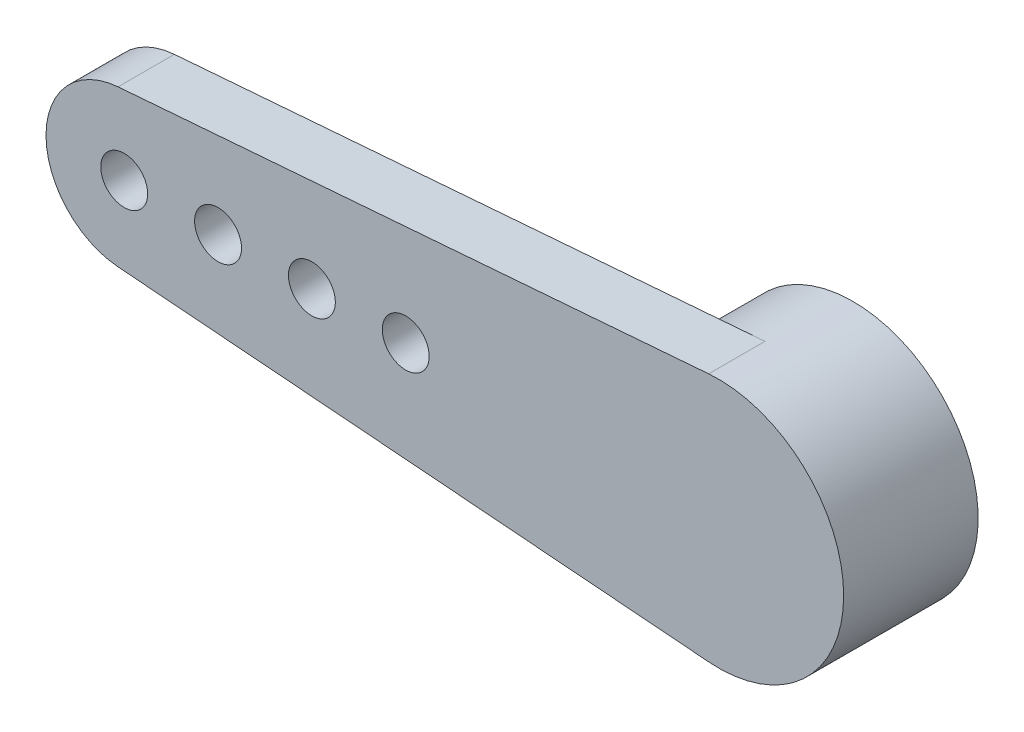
from build123d import *

# Parameters (mm, degrees)
ESQUISSE1_R      = 0.75
EXTRUSION6_DEPTH = 1.8
EXTRUSION8_START = 2.5
ESQUISSE3_R      = 4
EXTRUSION8_DEPTH = 2.5
ESQUISSE4_R      = 2.5
EXTRUSION9_DEPTH = 2.7


with BuildPart() as part:
    # Esquisse1 → Extrusion6 (new body)
    with BuildSketch(Plane.XY):
        with BuildLine():
            Line((-19.197368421, 2.492196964), (-0.315789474, 3.987515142))
            ThreePointArc((-0.315789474, 3.987515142), (4, 0), (-0.315789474, -3.987515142))
            Line((-0.315789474, -3.987515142), (-19.197368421, -2.492196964))
            ThreePointArc((-19.197368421, -2.492196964), (-21.5, 0), (-19.197368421, 2.492196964))
        make_face()
        with Locations((-10, 0)):
            Circle(ESQUISSE1_R, mode=Mode.SUBTRACT)
        with Locations((-19, 0)):
            Circle(ESQUISSE1_R, mode=Mode.SUBTRACT)
        with Locations((-16, 0)):
            Circle(ESQUISSE1_R, mode=Mode.SUBTRACT)
        with Locations((-13, 0)):
            Circle(ESQUISSE1_R, mode=Mode.SUBTRACT)
    extrude(amount=EXTRUSION6_DEPTH)

    # Esquisse3 → Extrusion8 (add)
    with BuildSketch(Plane(origin=(0, 0, 0), x_dir=(-1, 0, 0), z_dir=(0, 0, -1)).offset(EXTRUSION8_START)):
        Circle(ESQUISSE3_R)
    extrude(amount=-EXTRUSION8_DEPTH)

    # Esquisse4 → Extrusion9 (cut)
    with BuildSketch(Plane(origin=(0, 0, -2.5), x_dir=(-1, 0, 0), z_dir=(0, 0, -1))):
        Circle(ESQUISSE4_R)
    extrude(amount=-EXTRUSION9_DEPTH, mode=Mode.SUBTRACT)


solid = part.part
